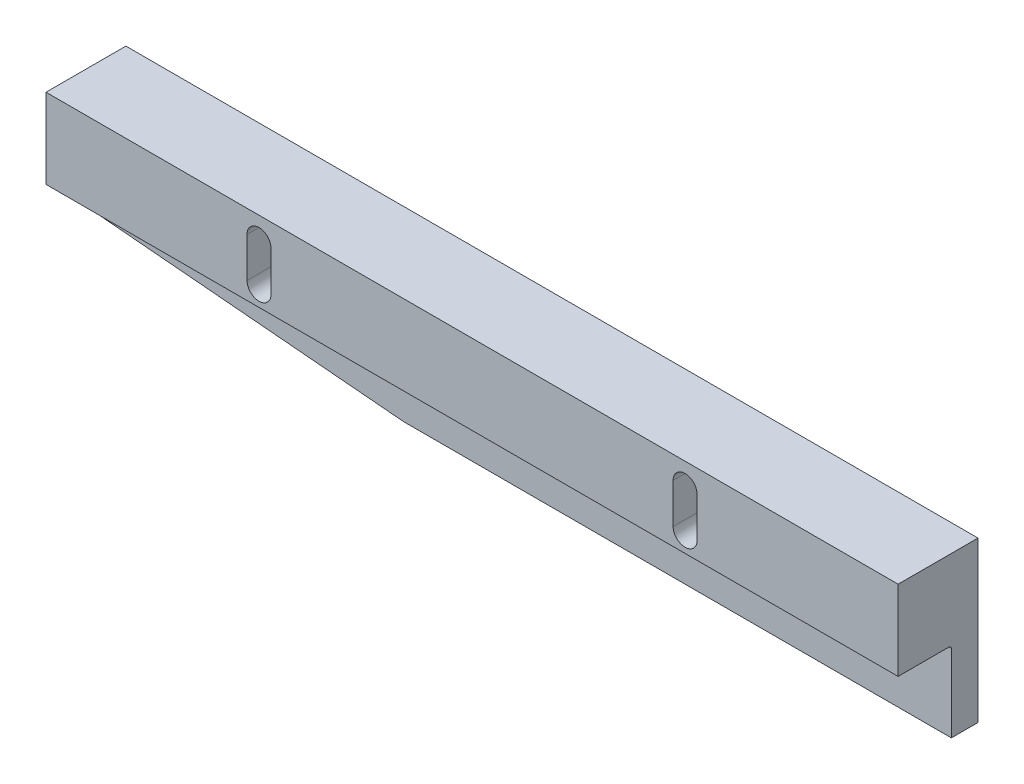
ISO-10303-21;
HEADER;
FILE_DESCRIPTION(('STEP AP214'),'2;1');
FILE_NAME('part.step','',(''),(''),'','','');
FILE_SCHEMA(('AUTOMOTIVE_DESIGN { 1 0 10303 214 1 1 1 1 }'));
ENDSEC;
DATA;
#1=APPLICATION_CONTEXT('core data for automotive mechanical design processes');
#2=APPLICATION_PROTOCOL_DEFINITION('international standard','automotive_design',2000,#1);
#3=PRODUCT_CONTEXT('',#1,'mechanical');
#4=PRODUCT('Part','Part','',(#3));
#5=PRODUCT_RELATED_PRODUCT_CATEGORY('part','',(#4));
#6=PRODUCT_DEFINITION_FORMATION('','',#4);
#7=PRODUCT_DEFINITION_CONTEXT('part definition',#1,'design');
#8=PRODUCT_DEFINITION('design','',#6,#7);
#9=PRODUCT_DEFINITION_SHAPE('','',#8);
#10=(LENGTH_UNIT() NAMED_UNIT(*) SI_UNIT(.MILLI.,.METRE.));
#11=(NAMED_UNIT(*) PLANE_ANGLE_UNIT() SI_UNIT($,.RADIAN.));
#12=(NAMED_UNIT(*) SI_UNIT($,.STERADIAN.) SOLID_ANGLE_UNIT());
#13=UNCERTAINTY_MEASURE_WITH_UNIT(LENGTH_MEASURE(1.E-05),#10,'distance_accuracy_value','');
#14=(GEOMETRIC_REPRESENTATION_CONTEXT(3) GLOBAL_UNCERTAINTY_ASSIGNED_CONTEXT((#13)) GLOBAL_UNIT_ASSIGNED_CONTEXT((#10,
#11,#12)) REPRESENTATION_CONTEXT('',''));
#15=CARTESIAN_POINT('',(0.,0.,0.));
#16=DIRECTION('',(0.,0.,1.));
#17=DIRECTION('',(1.,0.,0.));
#18=AXIS2_PLACEMENT_3D('',#15,#16,#17);
#19=CARTESIAN_POINT('',(0.,0.,-15.));
#20=DIRECTION('',(0.,0.,-1.));
#21=DIRECTION('',(1.,0.,0.));
#22=AXIS2_PLACEMENT_3D('',#19,#20,#21);
#23=PLANE('',#22);
#24=DIRECTION('',(0.,-1.,0.));
#25=VECTOR('',#24,1.);
#26=CARTESIAN_POINT('',(93.3117965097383,43.,-15.));
#27=LINE('',#26,#25);
#28=CARTESIAN_POINT('',(93.3117965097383,43.,-15.));
#29=VERTEX_POINT('',#28);
#30=CARTESIAN_POINT('',(93.3117965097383,18.,-15.));
#31=VERTEX_POINT('',#30);
#32=EDGE_CURVE('E308',#29,#31,#27,.T.);
#33=ORIENTED_EDGE('',*,*,#32,.F.);
#34=DIRECTION('',(-1.,0.,0.));
#35=VECTOR('',#34,1.);
#36=CARTESIAN_POINT('',(93.3117965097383,43.,-15.));
#37=LINE('',#36,#35);
#38=CARTESIAN_POINT('',(253.311796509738,43.,-15.));
#39=VERTEX_POINT('',#38);
#40=EDGE_CURVE('E318',#39,#29,#37,.T.);
#41=ORIENTED_EDGE('',*,*,#40,.F.);
#42=DIRECTION('',(0.,1.,0.));
#43=VECTOR('',#42,1.);
#44=CARTESIAN_POINT('',(253.311796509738,43.,-15.));
#45=LINE('',#44,#43);
#46=CARTESIAN_POINT('',(253.311796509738,13.,-15.));
#47=VERTEX_POINT('',#46);
#48=EDGE_CURVE('E315',#47,#39,#45,.T.);
#49=ORIENTED_EDGE('',*,*,#48,.F.);
#50=DIRECTION('',(1.,0.,0.));
#51=VECTOR('',#50,1.);
#52=CARTESIAN_POINT('',(93.3117965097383,13.,-15.));
#53=LINE('',#52,#51);
#54=CARTESIAN_POINT('',(150.462058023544,13.,-15.));
#55=VERTEX_POINT('',#54);
#56=EDGE_CURVE('E311',#55,#47,#53,.T.);
#57=ORIENTED_EDGE('',*,*,#56,.F.);
#58=DIRECTION('',(-0.996194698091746,0.0871557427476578,0.));
#59=VECTOR('',#58,1.);
#60=CARTESIAN_POINT('',(2.27164152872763,25.9649814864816,-15.));
#61=LINE('',#60,#59);
#62=EDGE_CURVE('E11',#31,#55,#61,.F.);
#63=ORIENTED_EDGE('',*,*,#62,.F.);
#64=EDGE_LOOP('',(#33,#41,#49,#57,#63));
#65=FACE_BOUND('',#64,.T.);
#66=CARTESIAN_POINT('',(213.311796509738,38.75,-15.));
#67=DIRECTION('',(0.,0.,1.));
#68=DIRECTION('',(1.,0.,0.));
#69=AXIS2_PLACEMENT_3D('',#66,#67,#68);
#70=CIRCLE('',#69,4.);
#71=CARTESIAN_POINT('',(217.311796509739,38.75,-15.));
#72=VERTEX_POINT('',#71);
#73=CARTESIAN_POINT('',(209.311796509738,38.75,-15.));
#74=VERTEX_POINT('',#73);
#75=EDGE_CURVE('E256',#72,#74,#70,.T.);
#76=ORIENTED_EDGE('',*,*,#75,.T.);
#77=DIRECTION('',(0.,-1.,0.));
#78=VECTOR('',#77,1.);
#79=CARTESIAN_POINT('',(209.311796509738,38.75,-15.));
#80=LINE('',#79,#78);
#81=CARTESIAN_POINT('',(209.311796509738,31.25,-15.));
#82=VERTEX_POINT('',#81);
#83=EDGE_CURVE('E228',#74,#82,#80,.T.);
#84=ORIENTED_EDGE('',*,*,#83,.T.);
#85=CARTESIAN_POINT('',(213.311796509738,31.25,-15.));
#86=DIRECTION('',(0.,0.,1.));
#87=DIRECTION('',(1.,0.,0.));
#88=AXIS2_PLACEMENT_3D('',#85,#86,#87);
#89=CIRCLE('',#88,4.);
#90=CARTESIAN_POINT('',(217.311796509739,31.25,-15.));
#91=VERTEX_POINT('',#90);
#92=EDGE_CURVE('E276',#82,#91,#89,.T.);
#93=ORIENTED_EDGE('',*,*,#92,.T.);
#94=DIRECTION('',(0.,-1.,0.));
#95=VECTOR('',#94,1.);
#96=CARTESIAN_POINT('',(217.311796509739,38.75,-15.));
#97=LINE('',#96,#95);
#98=EDGE_CURVE('E247',#72,#91,#97,.T.);
#99=ORIENTED_EDGE('',*,*,#98,.F.);
#100=EDGE_LOOP('',(#76,#84,#93,#99));
#101=FACE_BOUND('',#100,.T.);
#102=CARTESIAN_POINT('',(133.311796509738,38.75,-15.));
#103=DIRECTION('',(0.,0.,1.));
#104=DIRECTION('',(1.,0.,0.));
#105=AXIS2_PLACEMENT_3D('',#102,#103,#104);
#106=CIRCLE('',#105,4.);
#107=CARTESIAN_POINT('',(137.311796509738,38.75,-15.));
#108=VERTEX_POINT('',#107);
#109=CARTESIAN_POINT('',(129.311796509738,38.75,-15.));
#110=VERTEX_POINT('',#109);
#111=EDGE_CURVE('E191',#108,#110,#106,.T.);
#112=ORIENTED_EDGE('',*,*,#111,.T.);
#113=DIRECTION('',(0.,-1.,0.));
#114=VECTOR('',#113,1.);
#115=CARTESIAN_POINT('',(129.311796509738,38.75,-15.));
#116=LINE('',#115,#114);
#117=CARTESIAN_POINT('',(129.311796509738,31.25,-15.));
#118=VERTEX_POINT('',#117);
#119=EDGE_CURVE('E472',#110,#118,#116,.T.);
#120=ORIENTED_EDGE('',*,*,#119,.T.);
#121=CARTESIAN_POINT('',(133.311796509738,31.25,-15.));
#122=DIRECTION('',(0.,0.,1.));
#123=DIRECTION('',(1.,0.,0.));
#124=AXIS2_PLACEMENT_3D('',#121,#122,#123);
#125=CIRCLE('',#124,4.);
#126=CARTESIAN_POINT('',(137.311796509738,31.25,-15.));
#127=VERTEX_POINT('',#126);
#128=EDGE_CURVE('E193',#118,#127,#125,.T.);
#129=ORIENTED_EDGE('',*,*,#128,.T.);
#130=DIRECTION('',(0.,-1.,0.));
#131=VECTOR('',#130,1.);
#132=CARTESIAN_POINT('',(137.311796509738,38.75,-15.));
#133=LINE('',#132,#131);
#134=EDGE_CURVE('E177',#108,#127,#133,.T.);
#135=ORIENTED_EDGE('',*,*,#134,.F.);
#136=EDGE_LOOP('',(#112,#120,#129,#135));
#137=FACE_BOUND('',#136,.T.);
#138=ADVANCED_FACE('F16',(#65,#101,#137),#23,.T.);
#139=CARTESIAN_POINT('',(0.,0.,0.));
#140=DIRECTION('',(0.,0.,-1.));
#141=DIRECTION('',(1.,0.,0.));
#142=AXIS2_PLACEMENT_3D('',#139,#140,#141);
#143=PLANE('',#142);
#144=DIRECTION('',(0.,-1.,0.));
#145=VECTOR('',#144,1.);
#146=CARTESIAN_POINT('',(135.561796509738,38.75,0.));
#147=LINE('',#146,#145);
#148=CARTESIAN_POINT('',(135.561796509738,38.75,0.));
#149=VERTEX_POINT('',#148);
#150=CARTESIAN_POINT('',(135.561796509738,31.25,0.));
#151=VERTEX_POINT('',#150);
#152=EDGE_CURVE('E484',#149,#151,#147,.T.);
#153=ORIENTED_EDGE('',*,*,#152,.T.);
#154=CARTESIAN_POINT('',(133.311796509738,31.25,0.));
#155=DIRECTION('',(0.,0.,1.));
#156=DIRECTION('',(1.,0.,0.));
#157=AXIS2_PLACEMENT_3D('',#154,#155,#156);
#158=CIRCLE('',#157,2.25);
#159=CARTESIAN_POINT('',(131.061796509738,31.25,0.));
#160=VERTEX_POINT('',#159);
#161=EDGE_CURVE('E223',#160,#151,#158,.T.);
#162=ORIENTED_EDGE('',*,*,#161,.F.);
#163=DIRECTION('',(0.,-1.,0.));
#164=VECTOR('',#163,1.);
#165=CARTESIAN_POINT('',(131.061796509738,38.75,0.));
#166=LINE('',#165,#164);
#167=CARTESIAN_POINT('',(131.061796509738,38.75,0.));
#168=VERTEX_POINT('',#167);
#169=EDGE_CURVE('E481',#168,#160,#166,.T.);
#170=ORIENTED_EDGE('',*,*,#169,.F.);
#171=CARTESIAN_POINT('',(133.311796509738,38.75,0.));
#172=DIRECTION('',(0.,0.,1.));
#173=DIRECTION('',(1.,0.,0.));
#174=AXIS2_PLACEMENT_3D('',#171,#172,#173);
#175=CIRCLE('',#174,2.25);
#176=EDGE_CURVE('E206',#149,#168,#175,.T.);
#177=ORIENTED_EDGE('',*,*,#176,.F.);
#178=EDGE_LOOP('',(#153,#162,#170,#177));
#179=FACE_BOUND('',#178,.T.);
#180=DIRECTION('',(0.,1.,0.));
#181=VECTOR('',#180,1.);
#182=CARTESIAN_POINT('',(253.311796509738,43.,0.));
#183=LINE('',#182,#181);
#184=CARTESIAN_POINT('',(253.311796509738,28.,0.));
#185=VERTEX_POINT('',#184);
#186=CARTESIAN_POINT('',(253.311796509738,43.,0.));
#187=VERTEX_POINT('',#186);
#188=EDGE_CURVE('E324',#185,#187,#183,.T.);
#189=ORIENTED_EDGE('',*,*,#188,.T.);
#190=DIRECTION('',(-1.,0.,0.));
#191=VECTOR('',#190,1.);
#192=CARTESIAN_POINT('',(93.3117965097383,43.,0.));
#193=LINE('',#192,#191);
#194=CARTESIAN_POINT('',(93.3117965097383,43.,0.));
#195=VERTEX_POINT('',#194);
#196=EDGE_CURVE('E312',#187,#195,#193,.T.);
#197=ORIENTED_EDGE('',*,*,#196,.T.);
#198=DIRECTION('',(0.,-1.,0.));
#199=VECTOR('',#198,1.);
#200=CARTESIAN_POINT('',(93.3117965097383,43.,0.));
#201=LINE('',#200,#199);
#202=CARTESIAN_POINT('',(93.3117965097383,28.,0.));
#203=VERTEX_POINT('',#202);
#204=EDGE_CURVE('E305',#195,#203,#201,.T.);
#205=ORIENTED_EDGE('',*,*,#204,.T.);
#206=DIRECTION('',(1.,0.,0.));
#207=VECTOR('',#206,1.);
#208=CARTESIAN_POINT('',(93.3117965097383,28.,0.));
#209=LINE('',#208,#207);
#210=EDGE_CURVE('E298',#203,#185,#209,.T.);
#211=ORIENTED_EDGE('',*,*,#210,.T.);
#212=EDGE_LOOP('',(#189,#197,#205,#211));
#213=FACE_BOUND('',#212,.T.);
#214=DIRECTION('',(0.,-1.,0.));
#215=VECTOR('',#214,1.);
#216=CARTESIAN_POINT('',(215.561796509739,38.75,0.));
#217=LINE('',#216,#215);
#218=CARTESIAN_POINT('',(215.561796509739,38.75,0.));
#219=VERTEX_POINT('',#218);
#220=CARTESIAN_POINT('',(215.561796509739,31.25,0.));
#221=VERTEX_POINT('',#220);
#222=EDGE_CURVE('E239',#219,#221,#217,.T.);
#223=ORIENTED_EDGE('',*,*,#222,.T.);
#224=CARTESIAN_POINT('',(213.311796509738,31.25,0.));
#225=DIRECTION('',(0.,0.,1.));
#226=DIRECTION('',(1.,0.,0.));
#227=AXIS2_PLACEMENT_3D('',#224,#225,#226);
#228=CIRCLE('',#227,2.25);
#229=CARTESIAN_POINT('',(211.061796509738,31.25,0.));
#230=VERTEX_POINT('',#229);
#231=EDGE_CURVE('E285',#230,#221,#228,.T.);
#232=ORIENTED_EDGE('',*,*,#231,.F.);
#233=DIRECTION('',(0.,-1.,0.));
#234=VECTOR('',#233,1.);
#235=CARTESIAN_POINT('',(211.061796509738,38.75,0.));
#236=LINE('',#235,#234);
#237=CARTESIAN_POINT('',(211.061796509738,38.75,0.));
#238=VERTEX_POINT('',#237);
#239=EDGE_CURVE('E236',#238,#230,#236,.T.);
#240=ORIENTED_EDGE('',*,*,#239,.F.);
#241=CARTESIAN_POINT('',(213.311796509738,38.75,0.));
#242=DIRECTION('',(0.,0.,1.));
#243=DIRECTION('',(1.,0.,0.));
#244=AXIS2_PLACEMENT_3D('',#241,#242,#243);
#245=CIRCLE('',#244,2.25);
#246=EDGE_CURVE('E265',#219,#238,#245,.T.);
#247=ORIENTED_EDGE('',*,*,#246,.F.);
#248=EDGE_LOOP('',(#223,#232,#240,#247));
#249=FACE_BOUND('',#248,.T.);
#250=ADVANCED_FACE('F375',(#179,#213,#249),#143,.F.);
#251=CARTESIAN_POINT('',(93.3117965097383,43.,-15.));
#252=DIRECTION('',(1.,0.,0.));
#253=DIRECTION('',(0.,0.,1.));
#254=AXIS2_PLACEMENT_3D('',#251,#252,#253);
#255=PLANE('',#254);
#256=DIRECTION('',(0.,-1.,0.));
#257=VECTOR('',#256,1.);
#258=CARTESIAN_POINT('',(93.3117965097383,13.,-10.));
#259=LINE('',#258,#257);
#260=CARTESIAN_POINT('',(93.3117965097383,27.5,-10.));
#261=VERTEX_POINT('',#260);
#262=CARTESIAN_POINT('',(93.3117965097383,18.,-10.));
#263=VERTEX_POINT('',#262);
#264=EDGE_CURVE('E294',#261,#263,#259,.T.);
#265=ORIENTED_EDGE('',*,*,#264,.F.);
#266=CARTESIAN_POINT('',(93.3117965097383,27.5,-9.5));
#267=DIRECTION('',(-1.,0.,0.));
#268=DIRECTION('',(0.,0.,1.));
#269=AXIS2_PLACEMENT_3D('',#266,#267,#268);
#270=CIRCLE('',#269,0.5);
#271=CARTESIAN_POINT('',(93.3117965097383,28.,-9.5));
#272=VERTEX_POINT('',#271);
#273=EDGE_CURVE('E342',#272,#261,#270,.T.);
#274=ORIENTED_EDGE('',*,*,#273,.F.);
#275=DIRECTION('',(0.,0.,-1.));
#276=VECTOR('',#275,1.);
#277=CARTESIAN_POINT('',(93.3117965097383,28.,0.));
#278=LINE('',#277,#276);
#279=EDGE_CURVE('E291',#203,#272,#278,.T.);
#280=ORIENTED_EDGE('',*,*,#279,.F.);
#281=ORIENTED_EDGE('',*,*,#204,.F.);
#282=DIRECTION('',(0.,0.,1.));
#283=VECTOR('',#282,1.);
#284=CARTESIAN_POINT('',(93.3117965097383,43.,-15.));
#285=LINE('',#284,#283);
#286=EDGE_CURVE('E321',#29,#195,#285,.T.);
#287=ORIENTED_EDGE('',*,*,#286,.F.);
#288=ORIENTED_EDGE('',*,*,#32,.T.);
#289=DIRECTION('',(0.,0.,-1.));
#290=VECTOR('',#289,1.);
#291=CARTESIAN_POINT('',(93.3117965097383,18.,-15.));
#292=LINE('',#291,#290);
#293=EDGE_CURVE('E24',#263,#31,#292,.T.);
#294=ORIENTED_EDGE('',*,*,#293,.F.);
#295=EDGE_LOOP('',(#265,#274,#280,#281,#287,#288,#294));
#296=FACE_BOUND('',#295,.T.);
#297=ADVANCED_FACE('F358',(#296),#255,.F.);
#298=CARTESIAN_POINT('',(93.3117965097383,13.,-15.));
#299=DIRECTION('',(0.,1.,0.));
#300=DIRECTION('',(0.,0.,-1.));
#301=AXIS2_PLACEMENT_3D('',#298,#299,#300);
#302=PLANE('',#301);
#303=ORIENTED_EDGE('',*,*,#56,.T.);
#304=DIRECTION('',(0.,0.,1.));
#305=VECTOR('',#304,1.);
#306=CARTESIAN_POINT('',(253.311796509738,13.,-15.));
#307=LINE('',#306,#305);
#308=CARTESIAN_POINT('',(253.311796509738,13.,-10.));
#309=VERTEX_POINT('',#308);
#310=EDGE_CURVE('E332',#47,#309,#307,.T.);
#311=ORIENTED_EDGE('',*,*,#310,.T.);
#312=DIRECTION('',(1.,0.,0.));
#313=VECTOR('',#312,1.);
#314=CARTESIAN_POINT('',(93.3117965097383,13.,-10.));
#315=LINE('',#314,#313);
#316=CARTESIAN_POINT('',(150.462058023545,13.,-10.));
#317=VERTEX_POINT('',#316);
#318=EDGE_CURVE('E302',#317,#309,#315,.T.);
#319=ORIENTED_EDGE('',*,*,#318,.F.);
#320=DIRECTION('',(0.,0.,1.));
#321=VECTOR('',#320,1.);
#322=CARTESIAN_POINT('',(150.462058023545,13.,-15.));
#323=LINE('',#322,#321);
#324=EDGE_CURVE('E345',#55,#317,#323,.T.);
#325=ORIENTED_EDGE('',*,*,#324,.F.);
#326=EDGE_LOOP('',(#303,#311,#319,#325));
#327=FACE_BOUND('',#326,.T.);
#328=ADVANCED_FACE('F350',(#327),#302,.F.);
#329=CARTESIAN_POINT('',(253.311796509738,43.,-15.));
#330=DIRECTION('',(-1.,0.,0.));
#331=DIRECTION('',(0.,0.,-1.));
#332=AXIS2_PLACEMENT_3D('',#329,#330,#331);
#333=PLANE('',#332);
#334=ORIENTED_EDGE('',*,*,#310,.F.);
#335=ORIENTED_EDGE('',*,*,#48,.T.);
#336=DIRECTION('',(0.,0.,1.));
#337=VECTOR('',#336,1.);
#338=CARTESIAN_POINT('',(253.311796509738,43.,-15.));
#339=LINE('',#338,#337);
#340=EDGE_CURVE('E330',#39,#187,#339,.T.);
#341=ORIENTED_EDGE('',*,*,#340,.T.);
#342=ORIENTED_EDGE('',*,*,#188,.F.);
#343=DIRECTION('',(0.,0.,-1.));
#344=VECTOR('',#343,1.);
#345=CARTESIAN_POINT('',(253.311796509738,28.,0.));
#346=LINE('',#345,#344);
#347=CARTESIAN_POINT('',(253.311796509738,28.,-9.5));
#348=VERTEX_POINT('',#347);
#349=EDGE_CURVE('E290',#185,#348,#346,.T.);
#350=ORIENTED_EDGE('',*,*,#349,.T.);
#351=CARTESIAN_POINT('',(253.311796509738,27.5,-9.5));
#352=DIRECTION('',(1.,0.,0.));
#353=DIRECTION('',(0.,0.,-1.));
#354=AXIS2_PLACEMENT_3D('',#351,#352,#353);
#355=CIRCLE('',#354,0.5);
#356=CARTESIAN_POINT('',(253.311796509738,27.5,-10.));
#357=VERTEX_POINT('',#356);
#358=EDGE_CURVE('E339',#357,#348,#355,.T.);
#359=ORIENTED_EDGE('',*,*,#358,.F.);
#360=DIRECTION('',(0.,-1.,0.));
#361=VECTOR('',#360,1.);
#362=CARTESIAN_POINT('',(253.311796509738,13.,-10.));
#363=LINE('',#362,#361);
#364=EDGE_CURVE('E295',#357,#309,#363,.T.);
#365=ORIENTED_EDGE('',*,*,#364,.T.);
#366=EDGE_LOOP('',(#334,#335,#341,#342,#350,#359,#365));
#367=FACE_BOUND('',#366,.T.);
#368=ADVANCED_FACE('F366',(#367),#333,.F.);
#369=CARTESIAN_POINT('',(93.3117965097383,43.,-15.));
#370=DIRECTION('',(0.,-1.,0.));
#371=DIRECTION('',(0.,0.,1.));
#372=AXIS2_PLACEMENT_3D('',#369,#370,#371);
#373=PLANE('',#372);
#374=ORIENTED_EDGE('',*,*,#196,.F.);
#375=ORIENTED_EDGE('',*,*,#340,.F.);
#376=ORIENTED_EDGE('',*,*,#40,.T.);
#377=ORIENTED_EDGE('',*,*,#286,.T.);
#378=EDGE_LOOP('',(#374,#375,#376,#377));
#379=FACE_BOUND('',#378,.T.);
#380=ADVANCED_FACE('F378',(#379),#373,.F.);
#381=CARTESIAN_POINT('',(93.3117965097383,13.,-10.));
#382=DIRECTION('',(0.,0.,-1.));
#383=DIRECTION('',(1.,0.,0.));
#384=AXIS2_PLACEMENT_3D('',#381,#382,#383);
#385=PLANE('',#384);
#386=ORIENTED_EDGE('',*,*,#318,.T.);
#387=ORIENTED_EDGE('',*,*,#364,.F.);
#388=DIRECTION('',(1.,0.,0.));
#389=VECTOR('',#388,1.);
#390=CARTESIAN_POINT('',(253.311796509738,27.5,-10.));
#391=LINE('',#390,#389);
#392=EDGE_CURVE('E335',#261,#357,#391,.T.);
#393=ORIENTED_EDGE('',*,*,#392,.F.);
#394=ORIENTED_EDGE('',*,*,#264,.T.);
#395=DIRECTION('',(0.996194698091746,-0.0871557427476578,0.));
#396=VECTOR('',#395,1.);
#397=CARTESIAN_POINT('',(150.462058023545,13.,-10.));
#398=LINE('',#397,#396);
#399=EDGE_CURVE('E34',#317,#263,#398,.F.);
#400=ORIENTED_EDGE('',*,*,#399,.F.);
#401=EDGE_LOOP('',(#386,#387,#393,#394,#400));
#402=FACE_BOUND('',#401,.T.);
#403=ADVANCED_FACE('F353',(#402),#385,.F.);
#404=CARTESIAN_POINT('',(93.3117965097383,28.,0.));
#405=DIRECTION('',(0.,1.,0.));
#406=DIRECTION('',(0.,0.,-1.));
#407=AXIS2_PLACEMENT_3D('',#404,#405,#406);
#408=PLANE('',#407);
#409=ORIENTED_EDGE('',*,*,#349,.F.);
#410=ORIENTED_EDGE('',*,*,#210,.F.);
#411=ORIENTED_EDGE('',*,*,#279,.T.);
#412=DIRECTION('',(1.,0.,0.));
#413=VECTOR('',#412,1.);
#414=CARTESIAN_POINT('',(93.3117965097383,28.,-9.5));
#415=LINE('',#414,#413);
#416=EDGE_CURVE('E337',#348,#272,#415,.F.);
#417=ORIENTED_EDGE('',*,*,#416,.F.);
#418=EDGE_LOOP('',(#409,#410,#411,#417));
#419=FACE_BOUND('',#418,.T.);
#420=ADVANCED_FACE('F373',(#419),#408,.F.);
#421=CARTESIAN_POINT('',(93.3117965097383,27.5,-9.5));
#422=DIRECTION('',(-1.,0.,0.));
#423=DIRECTION('',(0.,0.,-1.));
#424=AXIS2_PLACEMENT_3D('',#421,#422,#423);
#425=CYLINDRICAL_SURFACE('',#424,0.5);
#426=ORIENTED_EDGE('',*,*,#273,.T.);
#427=ORIENTED_EDGE('',*,*,#392,.T.);
#428=ORIENTED_EDGE('',*,*,#358,.T.);
#429=ORIENTED_EDGE('',*,*,#416,.T.);
#430=EDGE_LOOP('',(#426,#427,#428,#429));
#431=FACE_BOUND('',#430,.T.);
#432=ADVANCED_FACE('F370',(#431),#425,.F.);
#433=CARTESIAN_POINT('',(213.311796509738,31.25,-15.));
#434=DIRECTION('',(0.,0.,-1.));
#435=DIRECTION('',(1.,0.,0.));
#436=AXIS2_PLACEMENT_3D('',#433,#434,#435);
#437=CYLINDRICAL_SURFACE('',#436,2.25);
#438=CARTESIAN_POINT('',(213.311796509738,31.25,-10.4));
#439=DIRECTION('',(0.,0.,1.));
#440=DIRECTION('',(1.,0.,0.));
#441=AXIS2_PLACEMENT_3D('',#438,#439,#440);
#442=CIRCLE('',#441,2.25);
#443=CARTESIAN_POINT('',(211.061796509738,31.25,-10.4));
#444=VERTEX_POINT('',#443);
#445=CARTESIAN_POINT('',(215.561796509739,31.25,-10.4));
#446=VERTEX_POINT('',#445);
#447=EDGE_CURVE('E282',#444,#446,#442,.T.);
#448=ORIENTED_EDGE('',*,*,#447,.F.);
#449=DIRECTION('',(0.,0.,-1.));
#450=VECTOR('',#449,1.);
#451=CARTESIAN_POINT('',(211.061796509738,31.25,-15.));
#452=LINE('',#451,#450);
#453=EDGE_CURVE('E270',#444,#230,#452,.F.);
#454=ORIENTED_EDGE('',*,*,#453,.T.);
#455=ORIENTED_EDGE('',*,*,#231,.T.);
#456=DIRECTION('',(0.,0.,1.));
#457=VECTOR('',#456,1.);
#458=CARTESIAN_POINT('',(215.561796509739,31.25,0.));
#459=LINE('',#458,#457);
#460=EDGE_CURVE('E274',#446,#221,#459,.T.);
#461=ORIENTED_EDGE('',*,*,#460,.F.);
#462=EDGE_LOOP('',(#448,#454,#455,#461));
#463=FACE_BOUND('',#462,.T.);
#464=ADVANCED_FACE('F400',(#463),#437,.F.);
#465=CARTESIAN_POINT('',(215.561796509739,31.25,-10.4));
#466=DIRECTION('',(0.,0.,1.));
#467=DIRECTION('',(-1.,0.,0.));
#468=AXIS2_PLACEMENT_3D('',#465,#466,#467);
#469=PLANE('',#468);
#470=ORIENTED_EDGE('',*,*,#447,.T.);
#471=DIRECTION('',(0.,-1.,0.));
#472=VECTOR('',#471,1.);
#473=CARTESIAN_POINT('',(215.561796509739,38.75,-10.4));
#474=LINE('',#473,#472);
#475=CARTESIAN_POINT('',(215.561796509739,38.75,-10.4));
#476=VERTEX_POINT('',#475);
#477=EDGE_CURVE('E242',#476,#446,#474,.T.);
#478=ORIENTED_EDGE('',*,*,#477,.F.);
#479=CARTESIAN_POINT('',(213.311796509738,38.75,-10.4));
#480=DIRECTION('',(0.,0.,1.));
#481=DIRECTION('',(1.,0.,0.));
#482=AXIS2_PLACEMENT_3D('',#479,#480,#481);
#483=CIRCLE('',#482,2.25);
#484=CARTESIAN_POINT('',(211.061796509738,38.75,-10.4));
#485=VERTEX_POINT('',#484);
#486=EDGE_CURVE('E262',#476,#485,#483,.T.);
#487=ORIENTED_EDGE('',*,*,#486,.T.);
#488=DIRECTION('',(0.,-1.,0.));
#489=VECTOR('',#488,1.);
#490=CARTESIAN_POINT('',(211.061796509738,38.75,-10.4));
#491=LINE('',#490,#489);
#492=EDGE_CURVE('E234',#485,#444,#491,.T.);
#493=ORIENTED_EDGE('',*,*,#492,.T.);
#494=EDGE_LOOP('',(#470,#478,#487,#493));
#495=FACE_BOUND('',#494,.T.);
#496=CARTESIAN_POINT('',(213.311796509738,31.25,-10.4));
#497=DIRECTION('',(0.,0.,1.));
#498=DIRECTION('',(1.,0.,0.));
#499=AXIS2_PLACEMENT_3D('',#496,#497,#498);
#500=CIRCLE('',#499,4.);
#501=CARTESIAN_POINT('',(209.311796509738,31.25,-10.4));
#502=VERTEX_POINT('',#501);
#503=CARTESIAN_POINT('',(217.311796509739,31.25,-10.4));
#504=VERTEX_POINT('',#503);
#505=EDGE_CURVE('E279',#502,#504,#500,.T.);
#506=ORIENTED_EDGE('',*,*,#505,.F.);
#507=DIRECTION('',(0.,-1.,0.));
#508=VECTOR('',#507,1.);
#509=CARTESIAN_POINT('',(209.311796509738,38.75,-10.4));
#510=LINE('',#509,#508);
#511=CARTESIAN_POINT('',(209.311796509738,38.75,-10.4));
#512=VERTEX_POINT('',#511);
#513=EDGE_CURVE('E231',#512,#502,#510,.T.);
#514=ORIENTED_EDGE('',*,*,#513,.F.);
#515=CARTESIAN_POINT('',(213.311796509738,38.75,-10.4));
#516=DIRECTION('',(0.,0.,1.));
#517=DIRECTION('',(1.,0.,0.));
#518=AXIS2_PLACEMENT_3D('',#515,#516,#517);
#519=CIRCLE('',#518,4.);
#520=CARTESIAN_POINT('',(217.311796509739,38.75,-10.4));
#521=VERTEX_POINT('',#520);
#522=EDGE_CURVE('E259',#521,#512,#519,.T.);
#523=ORIENTED_EDGE('',*,*,#522,.F.);
#524=DIRECTION('',(0.,-1.,0.));
#525=VECTOR('',#524,1.);
#526=CARTESIAN_POINT('',(217.311796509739,38.75,-10.4));
#527=LINE('',#526,#525);
#528=EDGE_CURVE('E244',#521,#504,#527,.T.);
#529=ORIENTED_EDGE('',*,*,#528,.T.);
#530=EDGE_LOOP('',(#506,#514,#523,#529));
#531=FACE_BOUND('',#530,.T.);
#532=ADVANCED_FACE('F403',(#495,#531),#469,.F.);
#533=CARTESIAN_POINT('',(213.311796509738,31.25,-15.));
#534=DIRECTION('',(0.,0.,-1.));
#535=DIRECTION('',(1.,0.,0.));
#536=AXIS2_PLACEMENT_3D('',#533,#534,#535);
#537=CYLINDRICAL_SURFACE('',#536,4.);
#538=ORIENTED_EDGE('',*,*,#92,.F.);
#539=DIRECTION('',(0.,0.,-1.));
#540=VECTOR('',#539,1.);
#541=CARTESIAN_POINT('',(209.311796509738,31.25,-15.));
#542=LINE('',#541,#540);
#543=EDGE_CURVE('E288',#82,#502,#542,.F.);
#544=ORIENTED_EDGE('',*,*,#543,.T.);
#545=ORIENTED_EDGE('',*,*,#505,.T.);
#546=DIRECTION('',(0.,0.,1.));
#547=VECTOR('',#546,1.);
#548=CARTESIAN_POINT('',(217.311796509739,31.25,-10.4));
#549=LINE('',#548,#547);
#550=EDGE_CURVE('E272',#91,#504,#549,.T.);
#551=ORIENTED_EDGE('',*,*,#550,.F.);
#552=EDGE_LOOP('',(#538,#544,#545,#551));
#553=FACE_BOUND('',#552,.T.);
#554=ADVANCED_FACE('F407',(#553),#537,.F.);
#555=CARTESIAN_POINT('',(213.311796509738,38.75,-15.));
#556=DIRECTION('',(0.,0.,-1.));
#557=DIRECTION('',(1.,0.,0.));
#558=AXIS2_PLACEMENT_3D('',#555,#556,#557);
#559=CYLINDRICAL_SURFACE('',#558,2.25);
#560=ORIENTED_EDGE('',*,*,#246,.T.);
#561=DIRECTION('',(0.,0.,-1.));
#562=VECTOR('',#561,1.);
#563=CARTESIAN_POINT('',(211.061796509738,38.75,-15.));
#564=LINE('',#563,#562);
#565=EDGE_CURVE('E250',#238,#485,#564,.T.);
#566=ORIENTED_EDGE('',*,*,#565,.T.);
#567=ORIENTED_EDGE('',*,*,#486,.F.);
#568=DIRECTION('',(0.,0.,1.));
#569=VECTOR('',#568,1.);
#570=CARTESIAN_POINT('',(215.561796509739,38.75,0.));
#571=LINE('',#570,#569);
#572=EDGE_CURVE('E254',#476,#219,#571,.T.);
#573=ORIENTED_EDGE('',*,*,#572,.T.);
#574=EDGE_LOOP('',(#560,#566,#567,#573));
#575=FACE_BOUND('',#574,.T.);
#576=ADVANCED_FACE('F411',(#575),#559,.F.);
#577=CARTESIAN_POINT('',(213.311796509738,38.75,-15.));
#578=DIRECTION('',(0.,0.,-1.));
#579=DIRECTION('',(1.,0.,0.));
#580=AXIS2_PLACEMENT_3D('',#577,#578,#579);
#581=CYLINDRICAL_SURFACE('',#580,4.);
#582=ORIENTED_EDGE('',*,*,#522,.T.);
#583=DIRECTION('',(0.,0.,-1.));
#584=VECTOR('',#583,1.);
#585=CARTESIAN_POINT('',(209.311796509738,38.75,-15.));
#586=LINE('',#585,#584);
#587=EDGE_CURVE('E268',#512,#74,#586,.T.);
#588=ORIENTED_EDGE('',*,*,#587,.T.);
#589=ORIENTED_EDGE('',*,*,#75,.F.);
#590=DIRECTION('',(0.,0.,1.));
#591=VECTOR('',#590,1.);
#592=CARTESIAN_POINT('',(217.311796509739,38.75,-10.4));
#593=LINE('',#592,#591);
#594=EDGE_CURVE('E252',#72,#521,#593,.T.);
#595=ORIENTED_EDGE('',*,*,#594,.T.);
#596=EDGE_LOOP('',(#582,#588,#589,#595));
#597=FACE_BOUND('',#596,.T.);
#598=ADVANCED_FACE('F415',(#597),#581,.F.);
#599=CARTESIAN_POINT('',(217.311796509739,38.75,-10.4));
#600=DIRECTION('',(-1.,0.,0.));
#601=DIRECTION('',(0.,0.,-1.));
#602=AXIS2_PLACEMENT_3D('',#599,#600,#601);
#603=PLANE('',#602);
#604=ORIENTED_EDGE('',*,*,#550,.T.);
#605=ORIENTED_EDGE('',*,*,#528,.F.);
#606=ORIENTED_EDGE('',*,*,#594,.F.);
#607=ORIENTED_EDGE('',*,*,#98,.T.);
#608=EDGE_LOOP('',(#604,#605,#606,#607));
#609=FACE_BOUND('',#608,.T.);
#610=ADVANCED_FACE('F419',(#609),#603,.T.);
#611=CARTESIAN_POINT('',(215.561796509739,38.75,0.));
#612=DIRECTION('',(-1.,0.,0.));
#613=DIRECTION('',(0.,0.,-1.));
#614=AXIS2_PLACEMENT_3D('',#611,#612,#613);
#615=PLANE('',#614);
#616=ORIENTED_EDGE('',*,*,#460,.T.);
#617=ORIENTED_EDGE('',*,*,#222,.F.);
#618=ORIENTED_EDGE('',*,*,#572,.F.);
#619=ORIENTED_EDGE('',*,*,#477,.T.);
#620=EDGE_LOOP('',(#616,#617,#618,#619));
#621=FACE_BOUND('',#620,.T.);
#622=ADVANCED_FACE('F423',(#621),#615,.T.);
#623=CARTESIAN_POINT('',(211.061796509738,38.75,-15.));
#624=DIRECTION('',(-1.,0.,0.));
#625=DIRECTION('',(0.,0.,-1.));
#626=AXIS2_PLACEMENT_3D('',#623,#624,#625);
#627=PLANE('',#626);
#628=ORIENTED_EDGE('',*,*,#453,.F.);
#629=ORIENTED_EDGE('',*,*,#492,.F.);
#630=ORIENTED_EDGE('',*,*,#565,.F.);
#631=ORIENTED_EDGE('',*,*,#239,.T.);
#632=EDGE_LOOP('',(#628,#629,#630,#631));
#633=FACE_BOUND('',#632,.T.);
#634=ADVANCED_FACE('F427',(#633),#627,.F.);
#635=CARTESIAN_POINT('',(209.311796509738,38.75,-15.));
#636=DIRECTION('',(-1.,0.,0.));
#637=DIRECTION('',(0.,0.,-1.));
#638=AXIS2_PLACEMENT_3D('',#635,#636,#637);
#639=PLANE('',#638);
#640=ORIENTED_EDGE('',*,*,#543,.F.);
#641=ORIENTED_EDGE('',*,*,#83,.F.);
#642=ORIENTED_EDGE('',*,*,#587,.F.);
#643=ORIENTED_EDGE('',*,*,#513,.T.);
#644=EDGE_LOOP('',(#640,#641,#642,#643));
#645=FACE_BOUND('',#644,.T.);
#646=ADVANCED_FACE('F431',(#645),#639,.F.);
#647=CARTESIAN_POINT('',(133.311796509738,31.25,-15.));
#648=DIRECTION('',(0.,0.,-1.));
#649=DIRECTION('',(1.,0.,0.));
#650=AXIS2_PLACEMENT_3D('',#647,#648,#649);
#651=CYLINDRICAL_SURFACE('',#650,2.25);
#652=CARTESIAN_POINT('',(133.311796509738,31.25,-10.4));
#653=DIRECTION('',(0.,0.,1.));
#654=DIRECTION('',(1.,0.,0.));
#655=AXIS2_PLACEMENT_3D('',#652,#653,#654);
#656=CIRCLE('',#655,2.25);
#657=CARTESIAN_POINT('',(131.061796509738,31.25,-10.4));
#658=VERTEX_POINT('',#657);
#659=CARTESIAN_POINT('',(135.561796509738,31.25,-10.4));
#660=VERTEX_POINT('',#659);
#661=EDGE_CURVE('E220',#658,#660,#656,.T.);
#662=ORIENTED_EDGE('',*,*,#661,.F.);
#663=DIRECTION('',(0.,0.,-1.));
#664=VECTOR('',#663,1.);
#665=CARTESIAN_POINT('',(131.061796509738,31.25,-15.));
#666=LINE('',#665,#664);
#667=EDGE_CURVE('E210',#658,#160,#666,.F.);
#668=ORIENTED_EDGE('',*,*,#667,.T.);
#669=ORIENTED_EDGE('',*,*,#161,.T.);
#670=DIRECTION('',(0.,0.,1.));
#671=VECTOR('',#670,1.);
#672=CARTESIAN_POINT('',(135.561796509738,31.25,0.));
#673=LINE('',#672,#671);
#674=EDGE_CURVE('E214',#660,#151,#673,.T.);
#675=ORIENTED_EDGE('',*,*,#674,.F.);
#676=EDGE_LOOP('',(#662,#668,#669,#675));
#677=FACE_BOUND('',#676,.T.);
#678=ADVANCED_FACE('F435',(#677),#651,.F.);
#679=CARTESIAN_POINT('',(135.561796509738,31.25,-10.4));
#680=DIRECTION('',(0.,0.,1.));
#681=DIRECTION('',(-1.,0.,0.));
#682=AXIS2_PLACEMENT_3D('',#679,#680,#681);
#683=PLANE('',#682);
#684=ORIENTED_EDGE('',*,*,#661,.T.);
#685=DIRECTION('',(0.,-1.,0.));
#686=VECTOR('',#685,1.);
#687=CARTESIAN_POINT('',(135.561796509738,38.75,-10.4));
#688=LINE('',#687,#686);
#689=CARTESIAN_POINT('',(135.561796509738,38.75,-10.4));
#690=VERTEX_POINT('',#689);
#691=EDGE_CURVE('E487',#690,#660,#688,.T.);
#692=ORIENTED_EDGE('',*,*,#691,.F.);
#693=CARTESIAN_POINT('',(133.311796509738,38.75,-10.4));
#694=DIRECTION('',(0.,0.,1.));
#695=DIRECTION('',(1.,0.,0.));
#696=AXIS2_PLACEMENT_3D('',#693,#694,#695);
#697=CIRCLE('',#696,2.25);
#698=CARTESIAN_POINT('',(131.061796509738,38.75,-10.4));
#699=VERTEX_POINT('',#698);
#700=EDGE_CURVE('E200',#690,#699,#697,.T.);
#701=ORIENTED_EDGE('',*,*,#700,.T.);
#702=DIRECTION('',(0.,-1.,0.));
#703=VECTOR('',#702,1.);
#704=CARTESIAN_POINT('',(131.061796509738,38.75,-10.4));
#705=LINE('',#704,#703);
#706=EDGE_CURVE('E477',#699,#658,#705,.T.);
#707=ORIENTED_EDGE('',*,*,#706,.T.);
#708=EDGE_LOOP('',(#684,#692,#701,#707));
#709=FACE_BOUND('',#708,.T.);
#710=CARTESIAN_POINT('',(133.311796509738,31.25,-10.4));
#711=DIRECTION('',(0.,0.,1.));
#712=DIRECTION('',(1.,0.,0.));
#713=AXIS2_PLACEMENT_3D('',#710,#711,#712);
#714=CIRCLE('',#713,4.);
#715=CARTESIAN_POINT('',(129.311796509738,31.25,-10.4));
#716=VERTEX_POINT('',#715);
#717=CARTESIAN_POINT('',(137.311796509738,31.25,-10.4));
#718=VERTEX_POINT('',#717);
#719=EDGE_CURVE('E217',#716,#718,#714,.T.);
#720=ORIENTED_EDGE('',*,*,#719,.F.);
#721=DIRECTION('',(0.,-1.,0.));
#722=VECTOR('',#721,1.);
#723=CARTESIAN_POINT('',(129.311796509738,38.75,-10.4));
#724=LINE('',#723,#722);
#725=CARTESIAN_POINT('',(129.311796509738,38.75,-10.4));
#726=VERTEX_POINT('',#725);
#727=EDGE_CURVE('E474',#726,#716,#724,.T.);
#728=ORIENTED_EDGE('',*,*,#727,.F.);
#729=CARTESIAN_POINT('',(133.311796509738,38.75,-10.4));
#730=DIRECTION('',(0.,0.,1.));
#731=DIRECTION('',(1.,0.,0.));
#732=AXIS2_PLACEMENT_3D('',#729,#730,#731);
#733=CIRCLE('',#732,4.);
#734=CARTESIAN_POINT('',(137.311796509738,38.75,-10.4));
#735=VERTEX_POINT('',#734);
#736=EDGE_CURVE('E198',#735,#726,#733,.T.);
#737=ORIENTED_EDGE('',*,*,#736,.F.);
#738=DIRECTION('',(0.,-1.,0.));
#739=VECTOR('',#738,1.);
#740=CARTESIAN_POINT('',(137.311796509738,38.75,-10.4));
#741=LINE('',#740,#739);
#742=EDGE_CURVE('E180',#735,#718,#741,.T.);
#743=ORIENTED_EDGE('',*,*,#742,.T.);
#744=EDGE_LOOP('',(#720,#728,#737,#743));
#745=FACE_BOUND('',#744,.T.);
#746=ADVANCED_FACE('F439',(#709,#745),#683,.F.);
#747=CARTESIAN_POINT('',(133.311796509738,31.25,-15.));
#748=DIRECTION('',(0.,0.,-1.));
#749=DIRECTION('',(1.,0.,0.));
#750=AXIS2_PLACEMENT_3D('',#747,#748,#749);
#751=CYLINDRICAL_SURFACE('',#750,4.);
#752=ORIENTED_EDGE('',*,*,#128,.F.);
#753=DIRECTION('',(0.,0.,-1.));
#754=VECTOR('',#753,1.);
#755=CARTESIAN_POINT('',(129.311796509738,31.25,-15.));
#756=LINE('',#755,#754);
#757=EDGE_CURVE('E226',#118,#716,#756,.F.);
#758=ORIENTED_EDGE('',*,*,#757,.T.);
#759=ORIENTED_EDGE('',*,*,#719,.T.);
#760=DIRECTION('',(0.,0.,1.));
#761=VECTOR('',#760,1.);
#762=CARTESIAN_POINT('',(137.311796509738,31.25,-10.4));
#763=LINE('',#762,#761);
#764=EDGE_CURVE('E212',#127,#718,#763,.T.);
#765=ORIENTED_EDGE('',*,*,#764,.F.);
#766=EDGE_LOOP('',(#752,#758,#759,#765));
#767=FACE_BOUND('',#766,.T.);
#768=ADVANCED_FACE('F443',(#767),#751,.F.);
#769=CARTESIAN_POINT('',(133.311796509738,38.75,-15.));
#770=DIRECTION('',(0.,0.,-1.));
#771=DIRECTION('',(1.,0.,0.));
#772=AXIS2_PLACEMENT_3D('',#769,#770,#771);
#773=CYLINDRICAL_SURFACE('',#772,2.25);
#774=ORIENTED_EDGE('',*,*,#176,.T.);
#775=DIRECTION('',(0.,0.,-1.));
#776=VECTOR('',#775,1.);
#777=CARTESIAN_POINT('',(131.061796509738,38.75,-15.));
#778=LINE('',#777,#776);
#779=EDGE_CURVE('E186',#168,#699,#778,.T.);
#780=ORIENTED_EDGE('',*,*,#779,.T.);
#781=ORIENTED_EDGE('',*,*,#700,.F.);
#782=DIRECTION('',(0.,0.,1.));
#783=VECTOR('',#782,1.);
#784=CARTESIAN_POINT('',(135.561796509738,38.75,0.));
#785=LINE('',#784,#783);
#786=EDGE_CURVE('E185',#690,#149,#785,.T.);
#787=ORIENTED_EDGE('',*,*,#786,.T.);
#788=EDGE_LOOP('',(#774,#780,#781,#787));
#789=FACE_BOUND('',#788,.T.);
#790=ADVANCED_FACE('F447',(#789),#773,.F.);
#791=CARTESIAN_POINT('',(133.311796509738,38.75,-15.));
#792=DIRECTION('',(0.,0.,-1.));
#793=DIRECTION('',(1.,0.,0.));
#794=AXIS2_PLACEMENT_3D('',#791,#792,#793);
#795=CYLINDRICAL_SURFACE('',#794,4.);
#796=ORIENTED_EDGE('',*,*,#736,.T.);
#797=DIRECTION('',(0.,0.,-1.));
#798=VECTOR('',#797,1.);
#799=CARTESIAN_POINT('',(129.311796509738,38.75,-15.));
#800=LINE('',#799,#798);
#801=EDGE_CURVE('E196',#726,#110,#800,.T.);
#802=ORIENTED_EDGE('',*,*,#801,.T.);
#803=ORIENTED_EDGE('',*,*,#111,.F.);
#804=DIRECTION('',(0.,0.,1.));
#805=VECTOR('',#804,1.);
#806=CARTESIAN_POINT('',(137.311796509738,38.75,-10.4));
#807=LINE('',#806,#805);
#808=EDGE_CURVE('E174',#108,#735,#807,.T.);
#809=ORIENTED_EDGE('',*,*,#808,.T.);
#810=EDGE_LOOP('',(#796,#802,#803,#809));
#811=FACE_BOUND('',#810,.T.);
#812=ADVANCED_FACE('F195',(#811),#795,.F.);
#813=CARTESIAN_POINT('',(137.311796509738,38.75,-10.4));
#814=DIRECTION('',(-1.,0.,0.));
#815=DIRECTION('',(0.,0.,-1.));
#816=AXIS2_PLACEMENT_3D('',#813,#814,#815);
#817=PLANE('',#816);
#818=ORIENTED_EDGE('',*,*,#764,.T.);
#819=ORIENTED_EDGE('',*,*,#742,.F.);
#820=ORIENTED_EDGE('',*,*,#808,.F.);
#821=ORIENTED_EDGE('',*,*,#134,.T.);
#822=EDGE_LOOP('',(#818,#819,#820,#821));
#823=FACE_BOUND('',#822,.T.);
#824=ADVANCED_FACE('F176',(#823),#817,.T.);
#825=CARTESIAN_POINT('',(135.561796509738,38.75,0.));
#826=DIRECTION('',(-1.,0.,0.));
#827=DIRECTION('',(0.,0.,-1.));
#828=AXIS2_PLACEMENT_3D('',#825,#826,#827);
#829=PLANE('',#828);
#830=ORIENTED_EDGE('',*,*,#674,.T.);
#831=ORIENTED_EDGE('',*,*,#152,.F.);
#832=ORIENTED_EDGE('',*,*,#786,.F.);
#833=ORIENTED_EDGE('',*,*,#691,.T.);
#834=EDGE_LOOP('',(#830,#831,#832,#833));
#835=FACE_BOUND('',#834,.T.);
#836=ADVANCED_FACE('F456',(#835),#829,.T.);
#837=CARTESIAN_POINT('',(131.061796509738,38.75,-15.));
#838=DIRECTION('',(-1.,0.,0.));
#839=DIRECTION('',(0.,0.,-1.));
#840=AXIS2_PLACEMENT_3D('',#837,#838,#839);
#841=PLANE('',#840);
#842=ORIENTED_EDGE('',*,*,#667,.F.);
#843=ORIENTED_EDGE('',*,*,#706,.F.);
#844=ORIENTED_EDGE('',*,*,#779,.F.);
#845=ORIENTED_EDGE('',*,*,#169,.T.);
#846=EDGE_LOOP('',(#842,#843,#844,#845));
#847=FACE_BOUND('',#846,.T.);
#848=ADVANCED_FACE('F459',(#847),#841,.F.);
#849=CARTESIAN_POINT('',(129.311796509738,38.75,-15.));
#850=DIRECTION('',(-1.,0.,0.));
#851=DIRECTION('',(0.,0.,-1.));
#852=AXIS2_PLACEMENT_3D('',#849,#850,#851);
#853=PLANE('',#852);
#854=ORIENTED_EDGE('',*,*,#757,.F.);
#855=ORIENTED_EDGE('',*,*,#119,.F.);
#856=ORIENTED_EDGE('',*,*,#801,.F.);
#857=ORIENTED_EDGE('',*,*,#727,.T.);
#858=EDGE_LOOP('',(#854,#855,#856,#857));
#859=FACE_BOUND('',#858,.T.);
#860=ADVANCED_FACE('F463',(#859),#853,.F.);
#861=CARTESIAN_POINT('',(150.462058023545,13.,-15.));
#862=DIRECTION('',(0.0871557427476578,0.996194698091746,0.));
#863=DIRECTION('',(0.,0.,1.));
#864=AXIS2_PLACEMENT_3D('',#861,#862,#863);
#865=PLANE('',#864);
#866=ORIENTED_EDGE('',*,*,#62,.T.);
#867=ORIENTED_EDGE('',*,*,#324,.T.);
#868=ORIENTED_EDGE('',*,*,#399,.T.);
#869=ORIENTED_EDGE('',*,*,#293,.T.);
#870=EDGE_LOOP('',(#866,#867,#868,#869));
#871=FACE_BOUND('',#870,.T.);
#872=ADVANCED_FACE('F18',(#871),#865,.F.);
#873=CLOSED_SHELL('',(#138,#250,#297,#328,#368,#380,#403,#420,#432,#464,#532,#554,#576,#598,
#610,#622,#634,#646,#678,#746,#768,#790,#812,#824,#836,#848,#860,#872));
#874=MANIFOLD_SOLID_BREP('B1',#873);
#875=ADVANCED_BREP_SHAPE_REPRESENTATION('',(#18,#874),#14);
#876=SHAPE_DEFINITION_REPRESENTATION(#9,#875);
ENDSEC;
END-ISO-10303-21;
